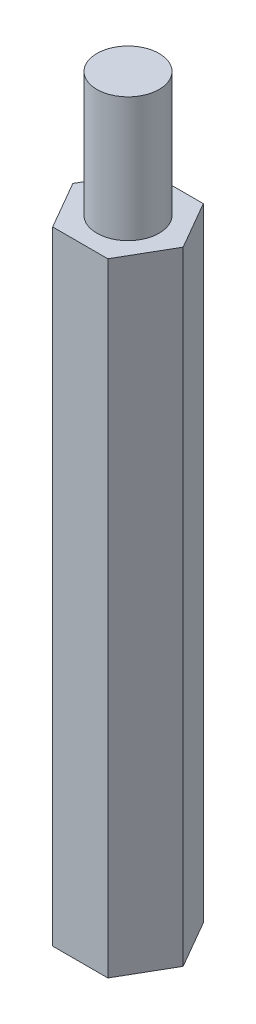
from build123d import *

# Parameters (mm, degrees)
EXTRUDE_1_DEPTH     = 30
SKETCH_2_R          = 1.5
EXTRUDE_2_DEPTH     = 6
SKETCH_3_R          = 1.5
CUT_EXTRUDE_1_DEPTH = 10


with BuildPart() as part:
    # Sketch 1 → Extrude 1 (new body)
    with BuildSketch(Plane(origin=(0, 0, 0), x_dir=(1, 0, 0), z_dir=(0, 1, 0))):
        Polygon((2.655811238, 0), (1.327905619, 2.3), (-1.327905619, 2.3), (-2.655811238, 0), (-1.327905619, -2.3), (1.327905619, -2.3), align=None)
    extrude(amount=EXTRUDE_1_DEPTH)

    # Sketch 2 → Extrude 2 (add)
    with BuildSketch(Plane(origin=(0, 30, 0), x_dir=(1, 0, 0), z_dir=(0, 1, 0))):
        with Locations(Location((0, 0, 0), (0, 0, 270))):
            Circle(SKETCH_2_R)
    extrude(amount=EXTRUDE_2_DEPTH)

    # Sketch 3 → Cut-Extrude 1 (cut)
    with BuildSketch(Plane.XZ):
        with Locations(Location((0, 0, 0), (0, 0, 90))):
            Circle(SKETCH_3_R)
    extrude(amount=-CUT_EXTRUDE_1_DEPTH, mode=Mode.SUBTRACT)


solid = part.part
